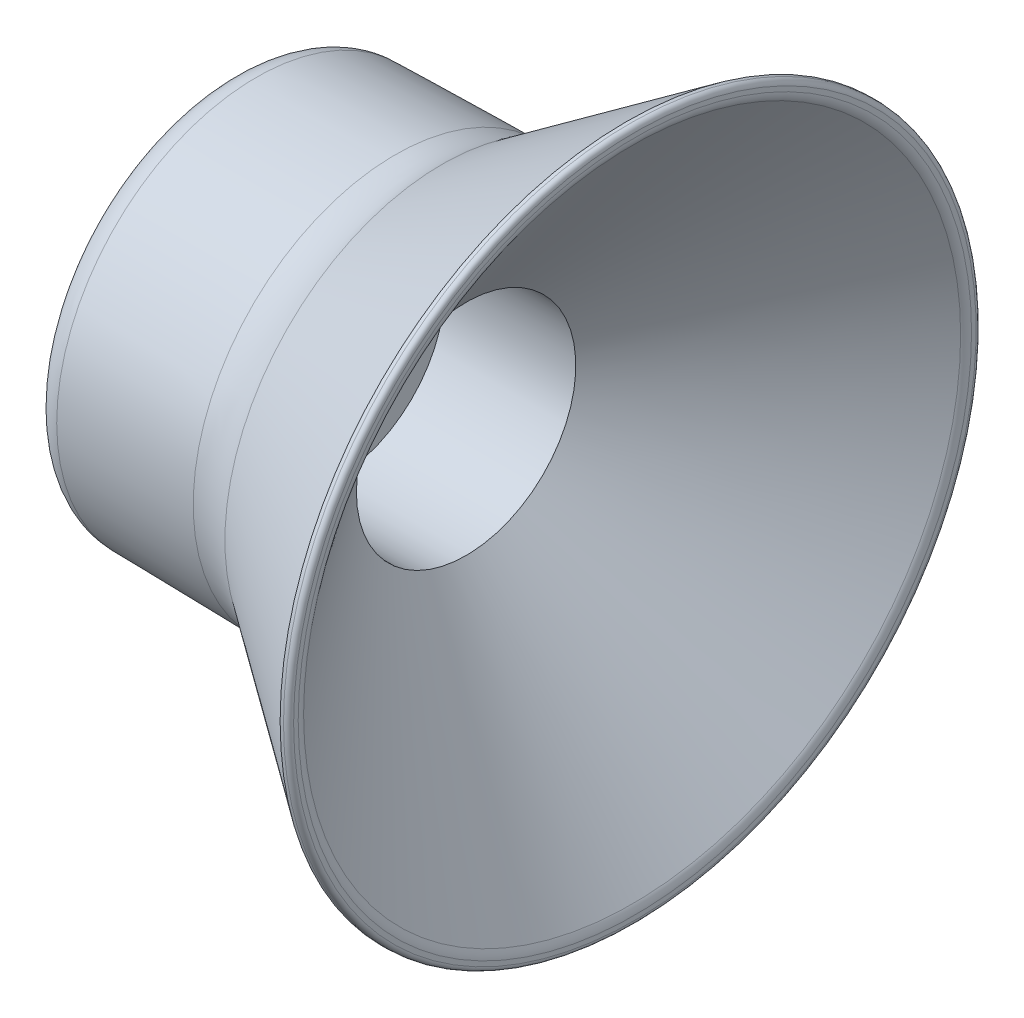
ISO-10303-21;
HEADER;
FILE_DESCRIPTION(('STEP AP214'),'2;1');
FILE_NAME('part.step','',(''),(''),'','','');
FILE_SCHEMA(('AUTOMOTIVE_DESIGN { 1 0 10303 214 1 1 1 1 }'));
ENDSEC;
DATA;
#1=APPLICATION_CONTEXT('core data for automotive mechanical design processes');
#2=APPLICATION_PROTOCOL_DEFINITION('international standard','automotive_design',2000,#1);
#3=PRODUCT_CONTEXT('',#1,'mechanical');
#4=PRODUCT('Part','Part','',(#3));
#5=PRODUCT_RELATED_PRODUCT_CATEGORY('part','',(#4));
#6=PRODUCT_DEFINITION_FORMATION('','',#4);
#7=PRODUCT_DEFINITION_CONTEXT('part definition',#1,'design');
#8=PRODUCT_DEFINITION('design','',#6,#7);
#9=PRODUCT_DEFINITION_SHAPE('','',#8);
#10=(LENGTH_UNIT() NAMED_UNIT(*) SI_UNIT(.MILLI.,.METRE.));
#11=(NAMED_UNIT(*) PLANE_ANGLE_UNIT() SI_UNIT($,.RADIAN.));
#12=(NAMED_UNIT(*) SI_UNIT($,.STERADIAN.) SOLID_ANGLE_UNIT());
#13=UNCERTAINTY_MEASURE_WITH_UNIT(LENGTH_MEASURE(1.E-05),#10,'distance_accuracy_value','');
#14=(GEOMETRIC_REPRESENTATION_CONTEXT(3) GLOBAL_UNCERTAINTY_ASSIGNED_CONTEXT((#13)) GLOBAL_UNIT_ASSIGNED_CONTEXT((#10,
#11,#12)) REPRESENTATION_CONTEXT('',''));
#15=CARTESIAN_POINT('',(0.,0.,0.));
#16=DIRECTION('',(0.,0.,1.));
#17=DIRECTION('',(1.,0.,0.));
#18=AXIS2_PLACEMENT_3D('',#15,#16,#17);
#19=CARTESIAN_POINT('',(0.,0.,0.));
#20=DIRECTION('',(1.,0.,0.));
#21=DIRECTION('',(0.,0.,-1.));
#22=AXIS2_PLACEMENT_3D('',#19,#20,#21);
#23=PLANE('',#22);
#24=CARTESIAN_POINT('',(0.,0.,0.));
#25=DIRECTION('',(-1.,0.,0.));
#26=DIRECTION('',(0.,0.,1.));
#27=AXIS2_PLACEMENT_3D('',#24,#25,#26);
#28=CIRCLE('',#27,6.096);
#29=CARTESIAN_POINT('',(0.,0.,6.096));
#30=VERTEX_POINT('',#29);
#31=EDGE_CURVE('E83',#30,#30,#28,.T.);
#32=ORIENTED_EDGE('',*,*,#31,.F.);
#33=EDGE_LOOP('',(#32));
#34=FACE_BOUND('',#33,.T.);
#35=CARTESIAN_POINT('',(0.,0.,0.));
#36=DIRECTION('',(1.,0.,0.));
#37=DIRECTION('',(0.,0.,-1.));
#38=AXIS2_PLACEMENT_3D('',#35,#36,#37);
#39=CIRCLE('',#38,12.9919481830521);
#40=CARTESIAN_POINT('',(0.,0.,-12.9919481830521));
#41=VERTEX_POINT('',#40);
#42=EDGE_CURVE('E51',#41,#41,#39,.F.);
#43=ORIENTED_EDGE('',*,*,#42,.T.);
#44=EDGE_LOOP('',(#43));
#45=FACE_BOUND('',#44,.T.);
#46=ADVANCED_FACE('F14',(#34,#45),#23,.F.);
#47=CARTESIAN_POINT('',(30.48,26.0604,0.));
#48=DIRECTION('',(-1.,0.,0.));
#49=DIRECTION('',(0.,0.,1.));
#50=AXIS2_PLACEMENT_3D('',#47,#48,#49);
#51=PLANE('',#50);
#52=CARTESIAN_POINT('',(30.48,0.,0.));
#53=DIRECTION('',(-1.,0.,0.));
#54=DIRECTION('',(0.,0.,1.));
#55=AXIS2_PLACEMENT_3D('',#52,#53,#54);
#56=CIRCLE('',#55,25.3354083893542);
#57=CARTESIAN_POINT('',(30.48,0.,25.3354083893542));
#58=VERTEX_POINT('',#57);
#59=EDGE_CURVE('E79',#58,#58,#56,.T.);
#60=ORIENTED_EDGE('',*,*,#59,.T.);
#61=EDGE_LOOP('',(#60));
#62=FACE_BOUND('',#61,.T.);
#63=CARTESIAN_POINT('',(30.48,0.,0.));
#64=DIRECTION('',(-1.,0.,0.));
#65=DIRECTION('',(0.,0.,1.));
#66=AXIS2_PLACEMENT_3D('',#63,#64,#65);
#67=CIRCLE('',#66,25.6794);
#68=CARTESIAN_POINT('',(30.48,0.,25.6794));
#69=VERTEX_POINT('',#68);
#70=EDGE_CURVE('E9',#69,#69,#67,.F.);
#71=ORIENTED_EDGE('',*,*,#70,.T.);
#72=EDGE_LOOP('',(#71));
#73=FACE_BOUND('',#72,.T.);
#74=ADVANCED_FACE('F96',(#62,#73),#51,.F.);
#75=CARTESIAN_POINT('',(14.3918673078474,0.,0.));
#76=DIRECTION('',(1.,0.,0.));
#77=DIRECTION('',(0.,0.,-1.));
#78=AXIS2_PLACEMENT_3D('',#75,#76,#77);
#79=CONICAL_SURFACE('',#78,15.24,0.0174532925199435);
#80=CARTESIAN_POINT('',(12.450773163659,0.,0.));
#81=DIRECTION('',(1.,0.,0.));
#82=DIRECTION('',(0.,0.,-1.));
#83=AXIS2_PLACEMENT_3D('',#80,#81,#82);
#84=CIRCLE('',#83,15.2061180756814);
#85=CARTESIAN_POINT('',(12.450773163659,0.,-15.2061180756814));
#86=VERTEX_POINT('',#85);
#87=EDGE_CURVE('E41',#86,#86,#84,.F.);
#88=ORIENTED_EDGE('',*,*,#87,.T.);
#89=EDGE_LOOP('',(#88));
#90=FACE_BOUND('',#89,.T.);
#91=CARTESIAN_POINT('',(1.99653671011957,0.,0.));
#92=DIRECTION('',(-1.,0.,0.));
#93=DIRECTION('',(0.,0.,1.));
#94=AXIS2_PLACEMENT_3D('',#91,#92,#93);
#95=CIRCLE('',#94,15.0236386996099);
#96=CARTESIAN_POINT('',(1.99653671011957,0.,15.0236386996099));
#97=VERTEX_POINT('',#96);
#98=EDGE_CURVE('E47',#97,#97,#95,.F.);
#99=ORIENTED_EDGE('',*,*,#98,.T.);
#100=EDGE_LOOP('',(#99));
#101=FACE_BOUND('',#100,.T.);
#102=ADVANCED_FACE('F117',(#90,#101),#79,.T.);
#103=CARTESIAN_POINT('',(29.845,0.,0.));
#104=DIRECTION('',(1.,0.,0.));
#105=DIRECTION('',(0.,0.,-1.));
#106=AXIS2_PLACEMENT_3D('',#103,#104,#105);
#107=CONICAL_SURFACE('',#106,26.0604,0.61086523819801);
#108=CARTESIAN_POINT('',(15.9821607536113,0.,0.));
#109=DIRECTION('',(1.,0.,0.));
#110=DIRECTION('',(0.,0.,-1.));
#111=AXIS2_PLACEMENT_3D('',#108,#109,#110);
#112=CIRCLE('',#111,16.3535354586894);
#113=CARTESIAN_POINT('',(15.9821607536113,0.,-16.3535354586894));
#114=VERTEX_POINT('',#113);
#115=EDGE_CURVE('E32',#114,#114,#112,.T.);
#116=ORIENTED_EDGE('',*,*,#115,.T.);
#117=EDGE_LOOP('',(#116));
#118=FACE_BOUND('',#117,.T.);
#119=CARTESIAN_POINT('',(29.845,0.,0.));
#120=DIRECTION('',(-1.,0.,0.));
#121=DIRECTION('',(0.,0.,1.));
#122=AXIS2_PLACEMENT_3D('',#119,#120,#121);
#123=CIRCLE('',#122,26.0604);
#124=CARTESIAN_POINT('',(29.845,0.,26.0604));
#125=VERTEX_POINT('',#124);
#126=EDGE_CURVE('E55',#125,#125,#123,.T.);
#127=ORIENTED_EDGE('',*,*,#126,.T.);
#128=EDGE_LOOP('',(#127));
#129=FACE_BOUND('',#128,.T.);
#130=ADVANCED_FACE('F113',(#118,#129),#107,.T.);
#131=CARTESIAN_POINT('',(0.,0.,0.));
#132=DIRECTION('',(-1.,0.,0.));
#133=DIRECTION('',(0.,0.,1.));
#134=AXIS2_PLACEMENT_3D('',#131,#132,#133);
#135=CYLINDRICAL_SURFACE('',#134,26.0604);
#136=CARTESIAN_POINT('',(30.099,0.,0.));
#137=DIRECTION('',(-1.,0.,0.));
#138=DIRECTION('',(0.,0.,1.));
#139=AXIS2_PLACEMENT_3D('',#136,#137,#138);
#140=CIRCLE('',#139,26.0604);
#141=CARTESIAN_POINT('',(30.099,0.,26.0604));
#142=VERTEX_POINT('',#141);
#143=EDGE_CURVE('E22',#142,#142,#140,.T.);
#144=ORIENTED_EDGE('',*,*,#143,.T.);
#145=EDGE_LOOP('',(#144));
#146=FACE_BOUND('',#145,.T.);
#147=ORIENTED_EDGE('',*,*,#126,.F.);
#148=EDGE_LOOP('',(#147));
#149=FACE_BOUND('',#148,.T.);
#150=ADVANCED_FACE('F103',(#146,#149),#135,.T.);
#151=CARTESIAN_POINT('',(2.032,0.,0.));
#152=DIRECTION('',(1.,0.,0.));
#153=DIRECTION('',(0.,0.,-1.));
#154=AXIS2_PLACEMENT_3D('',#151,#152,#153);
#155=TOROIDAL_SURFACE('',#154,12.9919481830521,2.032);
#156=ORIENTED_EDGE('',*,*,#98,.F.);
#157=EDGE_LOOP('',(#156));
#158=FACE_BOUND('',#157,.T.);
#159=ORIENTED_EDGE('',*,*,#42,.F.);
#160=EDGE_LOOP('',(#159));
#161=FACE_BOUND('',#160,.T.);
#162=ADVANCED_FACE('F100',(#158,#161),#155,.T.);
#163=CARTESIAN_POINT('',(12.3399503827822,0.,0.));
#164=DIRECTION('',(-1.,0.,0.));
#165=DIRECTION('',(0.,0.,1.));
#166=AXIS2_PLACEMENT_3D('',#163,#164,#165);
#167=TOROIDAL_SURFACE('',#166,21.5551509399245,6.35);
#168=ORIENTED_EDGE('',*,*,#115,.F.);
#169=EDGE_LOOP('',(#168));
#170=FACE_BOUND('',#169,.T.);
#171=ORIENTED_EDGE('',*,*,#87,.F.);
#172=EDGE_LOOP('',(#171));
#173=FACE_BOUND('',#172,.T.);
#174=ADVANCED_FACE('F102',(#170,#173),#167,.F.);
#175=CARTESIAN_POINT('',(30.099,0.,0.));
#176=DIRECTION('',(-1.,0.,0.));
#177=DIRECTION('',(0.,0.,1.));
#178=AXIS2_PLACEMENT_3D('',#175,#176,#177);
#179=TOROIDAL_SURFACE('',#178,25.6794,0.381);
#180=ORIENTED_EDGE('',*,*,#70,.F.);
#181=EDGE_LOOP('',(#180));
#182=FACE_BOUND('',#181,.T.);
#183=ORIENTED_EDGE('',*,*,#143,.F.);
#184=EDGE_LOOP('',(#183));
#185=FACE_BOUND('',#184,.T.);
#186=ADVANCED_FACE('F16',(#182,#185),#179,.T.);
#187=CARTESIAN_POINT('',(29.464,0.,0.));
#188=DIRECTION('',(-1.,0.,0.));
#189=DIRECTION('',(0.,0.,1.));
#190=AXIS2_PLACEMENT_3D('',#187,#188,#189);
#191=TOROIDAL_SURFACE('',#190,25.3354083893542,1.016);
#192=CARTESIAN_POINT('',(30.2733975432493,0.,0.));
#193=DIRECTION('',(1.,0.,0.));
#194=DIRECTION('',(0.,0.,-1.));
#195=AXIS2_PLACEMENT_3D('',#192,#193,#194);
#196=CIRCLE('',#195,24.7212979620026);
#197=CARTESIAN_POINT('',(30.2733975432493,0.,-24.7212979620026));
#198=VERTEX_POINT('',#197);
#199=EDGE_CURVE('E59',#198,#198,#196,.T.);
#200=ORIENTED_EDGE('',*,*,#199,.F.);
#201=EDGE_LOOP('',(#200));
#202=FACE_BOUND('',#201,.T.);
#203=ORIENTED_EDGE('',*,*,#59,.F.);
#204=EDGE_LOOP('',(#203));
#205=FACE_BOUND('',#204,.T.);
#206=ADVANCED_FACE('F127',(#202,#205),#191,.T.);
#207=CARTESIAN_POINT('',(30.48,0.,0.));
#208=DIRECTION('',(1.,0.,0.));
#209=DIRECTION('',(0.,0.,-1.));
#210=AXIS2_PLACEMENT_3D('',#207,#208,#209);
#211=CONICAL_SURFACE('',#210,24.9936,0.921734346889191);
#212=ORIENTED_EDGE('',*,*,#199,.T.);
#213=EDGE_LOOP('',(#212));
#214=FACE_BOUND('',#213,.T.);
#215=CARTESIAN_POINT('',(17.78,0.,0.));
#216=DIRECTION('',(-1.,0.,0.));
#217=DIRECTION('',(0.,0.,1.));
#218=AXIS2_PLACEMENT_3D('',#215,#216,#217);
#219=CIRCLE('',#218,8.255);
#220=CARTESIAN_POINT('',(17.78,0.,8.255));
#221=VERTEX_POINT('',#220);
#222=EDGE_CURVE('E63',#221,#221,#219,.T.);
#223=ORIENTED_EDGE('',*,*,#222,.T.);
#224=EDGE_LOOP('',(#223));
#225=FACE_BOUND('',#224,.T.);
#226=ADVANCED_FACE('F130',(#214,#225),#211,.F.);
#227=CARTESIAN_POINT('',(0.,0.,0.));
#228=DIRECTION('',(-1.,0.,0.));
#229=DIRECTION('',(0.,0.,1.));
#230=AXIS2_PLACEMENT_3D('',#227,#228,#229);
#231=CYLINDRICAL_SURFACE('',#230,8.255);
#232=CARTESIAN_POINT('',(7.89939999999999,0.,0.));
#233=DIRECTION('',(-1.,0.,0.));
#234=DIRECTION('',(0.,0.,1.));
#235=AXIS2_PLACEMENT_3D('',#232,#233,#234);
#236=CIRCLE('',#235,8.255);
#237=CARTESIAN_POINT('',(7.89939999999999,0.,8.255));
#238=VERTEX_POINT('',#237);
#239=EDGE_CURVE('E67',#238,#238,#236,.T.);
#240=ORIENTED_EDGE('',*,*,#239,.T.);
#241=EDGE_LOOP('',(#240));
#242=FACE_BOUND('',#241,.T.);
#243=ORIENTED_EDGE('',*,*,#222,.F.);
#244=EDGE_LOOP('',(#243));
#245=FACE_BOUND('',#244,.T.);
#246=ADVANCED_FACE('F134',(#242,#245),#231,.F.);
#247=CARTESIAN_POINT('',(7.89939999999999,4.572,0.));
#248=DIRECTION('',(1.,0.,0.));
#249=DIRECTION('',(0.,0.,-1.));
#250=AXIS2_PLACEMENT_3D('',#247,#248,#249);
#251=PLANE('',#250);
#252=CARTESIAN_POINT('',(7.89939999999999,0.,0.));
#253=DIRECTION('',(-1.,0.,0.));
#254=DIRECTION('',(0.,0.,1.));
#255=AXIS2_PLACEMENT_3D('',#252,#253,#254);
#256=CIRCLE('',#255,4.572);
#257=CARTESIAN_POINT('',(7.89939999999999,0.,4.572));
#258=VERTEX_POINT('',#257);
#259=EDGE_CURVE('E71',#258,#258,#256,.T.);
#260=ORIENTED_EDGE('',*,*,#259,.T.);
#261=EDGE_LOOP('',(#260));
#262=FACE_BOUND('',#261,.T.);
#263=ORIENTED_EDGE('',*,*,#239,.F.);
#264=EDGE_LOOP('',(#263));
#265=FACE_BOUND('',#264,.T.);
#266=ADVANCED_FACE('F138',(#262,#265),#251,.T.);
#267=CARTESIAN_POINT('',(0.,0.,0.));
#268=DIRECTION('',(-1.,0.,0.));
#269=DIRECTION('',(0.,0.,1.));
#270=AXIS2_PLACEMENT_3D('',#267,#268,#269);
#271=CYLINDRICAL_SURFACE('',#270,4.572);
#272=CARTESIAN_POINT('',(1.52399999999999,0.,0.));
#273=DIRECTION('',(-1.,0.,0.));
#274=DIRECTION('',(0.,0.,1.));
#275=AXIS2_PLACEMENT_3D('',#272,#273,#274);
#276=CIRCLE('',#275,4.572);
#277=CARTESIAN_POINT('',(1.52399999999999,0.,4.572));
#278=VERTEX_POINT('',#277);
#279=EDGE_CURVE('E75',#278,#278,#276,.T.);
#280=ORIENTED_EDGE('',*,*,#279,.T.);
#281=EDGE_LOOP('',(#280));
#282=FACE_BOUND('',#281,.T.);
#283=ORIENTED_EDGE('',*,*,#259,.F.);
#284=EDGE_LOOP('',(#283));
#285=FACE_BOUND('',#284,.T.);
#286=ADVANCED_FACE('F142',(#282,#285),#271,.F.);
#287=CARTESIAN_POINT('',(1.52399999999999,0.,0.));
#288=DIRECTION('',(-1.,0.,0.));
#289=DIRECTION('',(0.,0.,1.));
#290=AXIS2_PLACEMENT_3D('',#287,#288,#289);
#291=CONICAL_SURFACE('',#290,4.572,0.785398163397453);
#292=ORIENTED_EDGE('',*,*,#31,.T.);
#293=EDGE_LOOP('',(#292));
#294=FACE_BOUND('',#293,.T.);
#295=ORIENTED_EDGE('',*,*,#279,.F.);
#296=EDGE_LOOP('',(#295));
#297=FACE_BOUND('',#296,.T.);
#298=ADVANCED_FACE('F91',(#294,#297),#291,.F.);
#299=CLOSED_SHELL('',(#46,#74,#102,#130,#150,#162,#174,#186,#206,#226,#246,#266,#286,#298));
#300=MANIFOLD_SOLID_BREP('B1',#299);
#301=ADVANCED_BREP_SHAPE_REPRESENTATION('',(#18,#300),#14);
#302=SHAPE_DEFINITION_REPRESENTATION(#9,#301);
ENDSEC;
END-ISO-10303-21;
